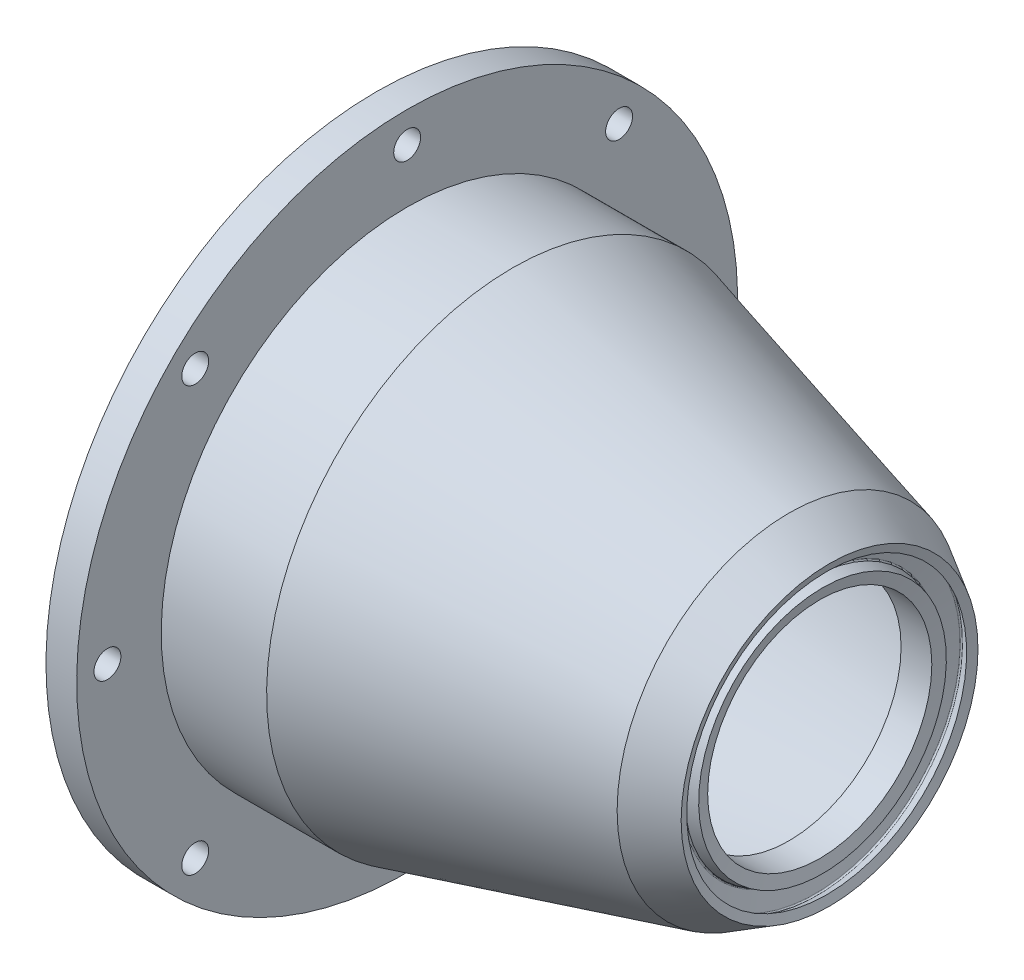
ISO-10303-21;
HEADER;
FILE_DESCRIPTION(('STEP AP214'),'2;1');
FILE_NAME('part.step','',(''),(''),'','','');
FILE_SCHEMA(('AUTOMOTIVE_DESIGN { 1 0 10303 214 1 1 1 1 }'));
ENDSEC;
DATA;
#1=APPLICATION_CONTEXT('core data for automotive mechanical design processes');
#2=APPLICATION_PROTOCOL_DEFINITION('international standard','automotive_design',2000,#1);
#3=PRODUCT_CONTEXT('',#1,'mechanical');
#4=PRODUCT('Part','Part','',(#3));
#5=PRODUCT_RELATED_PRODUCT_CATEGORY('part','',(#4));
#6=PRODUCT_DEFINITION_FORMATION('','',#4);
#7=PRODUCT_DEFINITION_CONTEXT('part definition',#1,'design');
#8=PRODUCT_DEFINITION('design','',#6,#7);
#9=PRODUCT_DEFINITION_SHAPE('','',#8);
#10=(LENGTH_UNIT() NAMED_UNIT(*) SI_UNIT(.MILLI.,.METRE.));
#11=(NAMED_UNIT(*) PLANE_ANGLE_UNIT() SI_UNIT($,.RADIAN.));
#12=(NAMED_UNIT(*) SI_UNIT($,.STERADIAN.) SOLID_ANGLE_UNIT());
#13=UNCERTAINTY_MEASURE_WITH_UNIT(LENGTH_MEASURE(1.E-05),#10,'distance_accuracy_value','');
#14=(GEOMETRIC_REPRESENTATION_CONTEXT(3) GLOBAL_UNCERTAINTY_ASSIGNED_CONTEXT((#13)) GLOBAL_UNIT_ASSIGNED_CONTEXT((#10,
#11,#12)) REPRESENTATION_CONTEXT('',''));
#15=CARTESIAN_POINT('',(0.,0.,0.));
#16=DIRECTION('',(0.,0.,1.));
#17=DIRECTION('',(1.,0.,0.));
#18=AXIS2_PLACEMENT_3D('',#15,#16,#17);
#19=CARTESIAN_POINT('',(-190.5,68.2625,0.));
#20=DIRECTION('',(-1.,0.,0.));
#21=DIRECTION('',(0.,-1.,0.));
#22=AXIS2_PLACEMENT_3D('',#19,#20,#21);
#23=PLANE('',#22);
#24=CARTESIAN_POINT('',(-190.5,0.,61.9125));
#25=DIRECTION('',(-1.,0.,0.));
#26=DIRECTION('',(0.,0.,1.));
#27=AXIS2_PLACEMENT_3D('',#24,#25,#26);
#28=CIRCLE('',#27,2.77812499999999);
#29=CARTESIAN_POINT('',(-190.5,0.,64.690625));
#30=VERTEX_POINT('',#29);
#31=EDGE_CURVE('E83',#30,#30,#28,.T.);
#32=ORIENTED_EDGE('',*,*,#31,.F.);
#33=EDGE_LOOP('',(#32));
#34=FACE_BOUND('',#33,.T.);
#35=CARTESIAN_POINT('',(-190.5,43.7787485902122,43.7787485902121));
#36=DIRECTION('',(-1.,0.,0.));
#37=DIRECTION('',(0.,0.,1.));
#38=AXIS2_PLACEMENT_3D('',#35,#36,#37);
#39=CIRCLE('',#38,2.77812499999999);
#40=CARTESIAN_POINT('',(-190.5,43.7787485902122,46.5568735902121));
#41=VERTEX_POINT('',#40);
#42=EDGE_CURVE('E73',#41,#41,#39,.T.);
#43=ORIENTED_EDGE('',*,*,#42,.F.);
#44=EDGE_LOOP('',(#43));
#45=FACE_BOUND('',#44,.T.);
#46=CARTESIAN_POINT('',(-190.5,61.9125000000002,0.));
#47=DIRECTION('',(-1.,0.,0.));
#48=DIRECTION('',(0.,0.,1.));
#49=AXIS2_PLACEMENT_3D('',#46,#47,#48);
#50=CIRCLE('',#49,2.77812499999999);
#51=CARTESIAN_POINT('',(-190.5,61.9125000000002,2.77812499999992));
#52=VERTEX_POINT('',#51);
#53=EDGE_CURVE('E70',#52,#52,#50,.T.);
#54=ORIENTED_EDGE('',*,*,#53,.F.);
#55=EDGE_LOOP('',(#54));
#56=FACE_BOUND('',#55,.T.);
#57=CARTESIAN_POINT('',(-190.5,-43.7787485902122,43.778748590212));
#58=DIRECTION('',(-1.,0.,0.));
#59=DIRECTION('',(0.,0.,1.));
#60=AXIS2_PLACEMENT_3D('',#57,#58,#59);
#61=CIRCLE('',#60,2.77812499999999);
#62=CARTESIAN_POINT('',(-190.5,-43.7787485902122,46.556873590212));
#63=VERTEX_POINT('',#62);
#64=EDGE_CURVE('E67',#63,#63,#61,.T.);
#65=ORIENTED_EDGE('',*,*,#64,.F.);
#66=EDGE_LOOP('',(#65));
#67=FACE_BOUND('',#66,.T.);
#68=CARTESIAN_POINT('',(-190.5,-61.9125000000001,-1.90819582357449E-13));
#69=DIRECTION('',(-1.,0.,0.));
#70=DIRECTION('',(0.,0.,1.));
#71=AXIS2_PLACEMENT_3D('',#68,#69,#70);
#72=CIRCLE('',#71,2.77812499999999);
#73=CARTESIAN_POINT('',(-190.5,-61.9125000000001,2.77812499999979));
#74=VERTEX_POINT('',#73);
#75=EDGE_CURVE('E63',#74,#74,#72,.T.);
#76=ORIENTED_EDGE('',*,*,#75,.F.);
#77=EDGE_LOOP('',(#76));
#78=FACE_BOUND('',#77,.T.);
#79=CARTESIAN_POINT('',(-190.5,43.7787485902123,-43.7787485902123));
#80=DIRECTION('',(-1.,0.,0.));
#81=DIRECTION('',(0.,0.,1.));
#82=AXIS2_PLACEMENT_3D('',#79,#80,#81);
#83=CIRCLE('',#82,2.77812499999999);
#84=CARTESIAN_POINT('',(-190.5,43.7787485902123,-41.0006235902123));
#85=VERTEX_POINT('',#84);
#86=EDGE_CURVE('E59',#85,#85,#83,.T.);
#87=ORIENTED_EDGE('',*,*,#86,.F.);
#88=EDGE_LOOP('',(#87));
#89=FACE_BOUND('',#88,.T.);
#90=CARTESIAN_POINT('',(-190.5,1.03024907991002E-13,-61.9125000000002));
#91=DIRECTION('',(-1.,0.,0.));
#92=DIRECTION('',(0.,0.,1.));
#93=AXIS2_PLACEMENT_3D('',#90,#91,#92);
#94=CIRCLE('',#93,2.77812499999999);
#95=CARTESIAN_POINT('',(-190.5,1.03024907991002E-13,-59.1343750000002));
#96=VERTEX_POINT('',#95);
#97=EDGE_CURVE('E55',#96,#96,#94,.T.);
#98=ORIENTED_EDGE('',*,*,#97,.F.);
#99=EDGE_LOOP('',(#98));
#100=FACE_BOUND('',#99,.T.);
#101=CARTESIAN_POINT('',(-190.5,-43.7787485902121,-43.7787485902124));
#102=DIRECTION('',(-1.,0.,0.));
#103=DIRECTION('',(0.,0.,1.));
#104=AXIS2_PLACEMENT_3D('',#101,#102,#103);
#105=CIRCLE('',#104,2.77812499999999);
#106=CARTESIAN_POINT('',(-190.5,-43.7787485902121,-41.0006235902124));
#107=VERTEX_POINT('',#106);
#108=EDGE_CURVE('E51',#107,#107,#105,.T.);
#109=ORIENTED_EDGE('',*,*,#108,.F.);
#110=EDGE_LOOP('',(#109));
#111=FACE_BOUND('',#110,.T.);
#112=CARTESIAN_POINT('',(-190.5,0.,0.));
#113=DIRECTION('',(1.,0.,0.));
#114=DIRECTION('',(0.,1.,0.));
#115=AXIS2_PLACEMENT_3D('',#112,#113,#114);
#116=CIRCLE('',#115,55.6117031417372);
#117=CARTESIAN_POINT('',(-190.5,55.6117031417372,0.));
#118=VERTEX_POINT('',#117);
#119=EDGE_CURVE('E50',#118,#118,#116,.T.);
#120=ORIENTED_EDGE('',*,*,#119,.T.);
#121=EDGE_LOOP('',(#120));
#122=FACE_BOUND('',#121,.T.);
#123=CARTESIAN_POINT('',(-190.5,0.,0.));
#124=DIRECTION('',(1.,0.,0.));
#125=DIRECTION('',(0.,1.,0.));
#126=AXIS2_PLACEMENT_3D('',#123,#124,#125);
#127=CIRCLE('',#126,68.2625);
#128=CARTESIAN_POINT('',(-190.5,68.2625,0.));
#129=VERTEX_POINT('',#128);
#130=EDGE_CURVE('E10',#129,#129,#127,.T.);
#131=ORIENTED_EDGE('',*,*,#130,.F.);
#132=EDGE_LOOP('',(#131));
#133=FACE_BOUND('',#132,.T.);
#134=ADVANCED_FACE('F31',(#34,#45,#56,#67,#78,#89,#100,#111,#122,#133),#23,.T.);
#135=CARTESIAN_POINT('',(0.,0.,0.));
#136=DIRECTION('',(1.,0.,0.));
#137=DIRECTION('',(0.,1.,0.));
#138=AXIS2_PLACEMENT_3D('',#135,#136,#137);
#139=CYLINDRICAL_SURFACE('',#138,68.2625);
#140=ORIENTED_EDGE('',*,*,#130,.T.);
#141=EDGE_LOOP('',(#140));
#142=FACE_BOUND('',#141,.T.);
#143=CARTESIAN_POINT('',(-184.15,0.,0.));
#144=DIRECTION('',(1.,0.,0.));
#145=DIRECTION('',(0.,1.,0.));
#146=AXIS2_PLACEMENT_3D('',#143,#144,#145);
#147=CIRCLE('',#146,68.2625);
#148=CARTESIAN_POINT('',(-184.15,68.2625,0.));
#149=VERTEX_POINT('',#148);
#150=EDGE_CURVE('E38',#149,#149,#147,.T.);
#151=ORIENTED_EDGE('',*,*,#150,.F.);
#152=EDGE_LOOP('',(#151));
#153=FACE_BOUND('',#152,.T.);
#154=ADVANCED_FACE('F168',(#142,#153),#139,.T.);
#155=CARTESIAN_POINT('',(-184.15,68.2625,0.));
#156=DIRECTION('',(1.,0.,0.));
#157=DIRECTION('',(0.,1.,0.));
#158=AXIS2_PLACEMENT_3D('',#155,#156,#157);
#159=PLANE('',#158);
#160=CARTESIAN_POINT('',(-184.15,0.,61.9125));
#161=DIRECTION('',(1.,0.,0.));
#162=DIRECTION('',(0.,1.,0.));
#163=AXIS2_PLACEMENT_3D('',#160,#161,#162);
#164=CIRCLE('',#163,2.77812499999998);
#165=CARTESIAN_POINT('',(-184.15,2.77812499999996,61.9125));
#166=VERTEX_POINT('',#165);
#167=EDGE_CURVE('E34',#166,#166,#164,.T.);
#168=ORIENTED_EDGE('',*,*,#167,.F.);
#169=EDGE_LOOP('',(#168));
#170=FACE_BOUND('',#169,.T.);
#171=CARTESIAN_POINT('',(-184.15,43.7787485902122,43.7787485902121));
#172=DIRECTION('',(1.,0.,0.));
#173=DIRECTION('',(0.,1.,0.));
#174=AXIS2_PLACEMENT_3D('',#171,#172,#173);
#175=CIRCLE('',#174,2.77812499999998);
#176=CARTESIAN_POINT('',(-184.15,46.5568735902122,43.7787485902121));
#177=VERTEX_POINT('',#176);
#178=EDGE_CURVE('E71',#177,#177,#175,.T.);
#179=ORIENTED_EDGE('',*,*,#178,.F.);
#180=EDGE_LOOP('',(#179));
#181=FACE_BOUND('',#180,.T.);
#182=CARTESIAN_POINT('',(-184.15,61.9125000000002,0.));
#183=DIRECTION('',(1.,0.,0.));
#184=DIRECTION('',(0.,1.,0.));
#185=AXIS2_PLACEMENT_3D('',#182,#183,#184);
#186=CIRCLE('',#185,2.77812499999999);
#187=CARTESIAN_POINT('',(-184.15,64.6906250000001,0.));
#188=VERTEX_POINT('',#187);
#189=EDGE_CURVE('E68',#188,#188,#186,.T.);
#190=ORIENTED_EDGE('',*,*,#189,.F.);
#191=EDGE_LOOP('',(#190));
#192=FACE_BOUND('',#191,.T.);
#193=CARTESIAN_POINT('',(-184.15,-43.7787485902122,43.778748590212));
#194=DIRECTION('',(1.,0.,0.));
#195=DIRECTION('',(0.,1.,0.));
#196=AXIS2_PLACEMENT_3D('',#193,#194,#195);
#197=CIRCLE('',#196,2.77812499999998);
#198=CARTESIAN_POINT('',(-184.15,-41.0006235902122,43.778748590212));
#199=VERTEX_POINT('',#198);
#200=EDGE_CURVE('E64',#199,#199,#197,.T.);
#201=ORIENTED_EDGE('',*,*,#200,.F.);
#202=EDGE_LOOP('',(#201));
#203=FACE_BOUND('',#202,.T.);
#204=CARTESIAN_POINT('',(-184.15,-61.9125000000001,-1.90819582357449E-13));
#205=DIRECTION('',(1.,0.,0.));
#206=DIRECTION('',(0.,1.,0.));
#207=AXIS2_PLACEMENT_3D('',#204,#205,#206);
#208=CIRCLE('',#207,2.77812499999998);
#209=CARTESIAN_POINT('',(-184.15,-59.1343750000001,-1.90819582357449E-13));
#210=VERTEX_POINT('',#209);
#211=EDGE_CURVE('E60',#210,#210,#208,.T.);
#212=ORIENTED_EDGE('',*,*,#211,.F.);
#213=EDGE_LOOP('',(#212));
#214=FACE_BOUND('',#213,.T.);
#215=CARTESIAN_POINT('',(-184.15,43.7787485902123,-43.7787485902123));
#216=DIRECTION('',(1.,0.,0.));
#217=DIRECTION('',(0.,1.,0.));
#218=AXIS2_PLACEMENT_3D('',#215,#216,#217);
#219=CIRCLE('',#218,2.77812499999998);
#220=CARTESIAN_POINT('',(-184.15,46.5568735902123,-43.7787485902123));
#221=VERTEX_POINT('',#220);
#222=EDGE_CURVE('E56',#221,#221,#219,.T.);
#223=ORIENTED_EDGE('',*,*,#222,.F.);
#224=EDGE_LOOP('',(#223));
#225=FACE_BOUND('',#224,.T.);
#226=CARTESIAN_POINT('',(-184.15,1.03024907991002E-13,-61.9125000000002));
#227=DIRECTION('',(1.,0.,0.));
#228=DIRECTION('',(0.,1.,0.));
#229=AXIS2_PLACEMENT_3D('',#226,#227,#228);
#230=CIRCLE('',#229,2.77812499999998);
#231=CARTESIAN_POINT('',(-184.15,2.77812500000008,-61.9125000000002));
#232=VERTEX_POINT('',#231);
#233=EDGE_CURVE('E52',#232,#232,#230,.T.);
#234=ORIENTED_EDGE('',*,*,#233,.F.);
#235=EDGE_LOOP('',(#234));
#236=FACE_BOUND('',#235,.T.);
#237=CARTESIAN_POINT('',(-184.15,-43.7787485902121,-43.7787485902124));
#238=DIRECTION('',(1.,0.,0.));
#239=DIRECTION('',(0.,1.,0.));
#240=AXIS2_PLACEMENT_3D('',#237,#238,#239);
#241=CIRCLE('',#240,2.77812499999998);
#242=CARTESIAN_POINT('',(-184.15,-41.0006235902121,-43.7787485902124));
#243=VERTEX_POINT('',#242);
#244=EDGE_CURVE('E47',#243,#243,#241,.T.);
#245=ORIENTED_EDGE('',*,*,#244,.F.);
#246=EDGE_LOOP('',(#245));
#247=FACE_BOUND('',#246,.T.);
#248=ORIENTED_EDGE('',*,*,#150,.T.);
#249=EDGE_LOOP('',(#248));
#250=FACE_BOUND('',#249,.T.);
#251=CARTESIAN_POINT('',(-184.15,0.,0.));
#252=DIRECTION('',(1.,0.,0.));
#253=DIRECTION('',(0.,1.,0.));
#254=AXIS2_PLACEMENT_3D('',#251,#252,#253);
#255=CIRCLE('',#254,50.8);
#256=CARTESIAN_POINT('',(-184.15,50.8,0.));
#257=VERTEX_POINT('',#256);
#258=EDGE_CURVE('E43',#257,#257,#255,.T.);
#259=ORIENTED_EDGE('',*,*,#258,.F.);
#260=EDGE_LOOP('',(#259));
#261=FACE_BOUND('',#260,.T.);
#262=ADVANCED_FACE('F166',(#170,#181,#192,#203,#214,#225,#236,#247,#250,#261),#159,.T.);
#263=CARTESIAN_POINT('',(0.,0.,0.));
#264=DIRECTION('',(1.,0.,0.));
#265=DIRECTION('',(0.,1.,0.));
#266=AXIS2_PLACEMENT_3D('',#263,#264,#265);
#267=CYLINDRICAL_SURFACE('',#266,50.8);
#268=ORIENTED_EDGE('',*,*,#258,.T.);
#269=EDGE_LOOP('',(#268));
#270=FACE_BOUND('',#269,.T.);
#271=CARTESIAN_POINT('',(-162.381972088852,0.,0.));
#272=DIRECTION('',(1.,0.,0.));
#273=DIRECTION('',(0.,1.,0.));
#274=AXIS2_PLACEMENT_3D('',#271,#272,#273);
#275=CIRCLE('',#274,50.8);
#276=CARTESIAN_POINT('',(-162.381972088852,50.8,0.));
#277=VERTEX_POINT('',#276);
#278=EDGE_CURVE('E158',#277,#277,#275,.T.);
#279=ORIENTED_EDGE('',*,*,#278,.F.);
#280=EDGE_LOOP('',(#279));
#281=FACE_BOUND('',#280,.T.);
#282=ADVANCED_FACE('F163',(#270,#281),#267,.T.);
#283=CARTESIAN_POINT('',(-105.280059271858,0.,0.));
#284=DIRECTION('',(-1.,0.,0.));
#285=DIRECTION('',(0.,-1.,0.));
#286=AXIS2_PLACEMENT_3D('',#283,#284,#285);
#287=CONICAL_SURFACE('',#286,35.4995885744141,0.26179938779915);
#288=ORIENTED_EDGE('',*,*,#278,.T.);
#289=EDGE_LOOP('',(#288));
#290=FACE_BOUND('',#289,.T.);
#291=CARTESIAN_POINT('',(-105.280059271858,0.,0.));
#292=DIRECTION('',(1.,0.,0.));
#293=DIRECTION('',(0.,1.,0.));
#294=AXIS2_PLACEMENT_3D('',#291,#292,#293);
#295=CIRCLE('',#294,35.4995885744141);
#296=CARTESIAN_POINT('',(-105.280059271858,35.4995885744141,0.));
#297=VERTEX_POINT('',#296);
#298=EDGE_CURVE('E155',#297,#297,#295,.T.);
#299=ORIENTED_EDGE('',*,*,#298,.F.);
#300=EDGE_LOOP('',(#299));
#301=FACE_BOUND('',#300,.T.);
#302=ADVANCED_FACE('F175',(#290,#301),#287,.T.);
#303=CARTESIAN_POINT('',(-96.8962445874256,0.,0.));
#304=DIRECTION('',(-1.,0.,0.));
#305=DIRECTION('',(0.,-1.,0.));
#306=AXIS2_PLACEMENT_3D('',#303,#304,#305);
#307=CONICAL_SURFACE('',#306,30.6591909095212,0.523598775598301);
#308=ORIENTED_EDGE('',*,*,#298,.T.);
#309=EDGE_LOOP('',(#308));
#310=FACE_BOUND('',#309,.T.);
#311=CARTESIAN_POINT('',(-96.8962445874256,0.,0.));
#312=DIRECTION('',(1.,0.,0.));
#313=DIRECTION('',(0.,1.,0.));
#314=AXIS2_PLACEMENT_3D('',#311,#312,#313);
#315=CIRCLE('',#314,30.6591909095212);
#316=CARTESIAN_POINT('',(-96.8962445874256,30.6591909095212,0.));
#317=VERTEX_POINT('',#316);
#318=EDGE_CURVE('E152',#317,#317,#315,.T.);
#319=ORIENTED_EDGE('',*,*,#318,.F.);
#320=EDGE_LOOP('',(#319));
#321=FACE_BOUND('',#320,.T.);
#322=ADVANCED_FACE('F286',(#310,#321),#307,.T.);
#323=CARTESIAN_POINT('',(-97.4972874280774,0.,0.));
#324=DIRECTION('',(1.,0.,0.));
#325=DIRECTION('',(0.,1.,0.));
#326=AXIS2_PLACEMENT_3D('',#323,#324,#325);
#327=CONICAL_SURFACE('',#326,28.9110715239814,1.23963538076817);
#328=ORIENTED_EDGE('',*,*,#318,.T.);
#329=EDGE_LOOP('',(#328));
#330=FACE_BOUND('',#329,.T.);
#331=CARTESIAN_POINT('',(-97.4972874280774,0.,0.));
#332=DIRECTION('',(1.,0.,0.));
#333=DIRECTION('',(0.,1.,0.));
#334=AXIS2_PLACEMENT_3D('',#331,#332,#333);
#335=CIRCLE('',#334,28.9110715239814);
#336=CARTESIAN_POINT('',(-97.4972874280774,28.9110715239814,0.));
#337=VERTEX_POINT('',#336);
#338=EDGE_CURVE('E149',#337,#337,#335,.T.);
#339=ORIENTED_EDGE('',*,*,#338,.F.);
#340=EDGE_LOOP('',(#339));
#341=FACE_BOUND('',#340,.T.);
#342=ADVANCED_FACE('F282',(#330,#341),#327,.F.);
#343=CARTESIAN_POINT('',(-99.4838969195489,0.,0.));
#344=DIRECTION('',(-1.,0.,0.));
#345=DIRECTION('',(0.,-1.,0.));
#346=AXIS2_PLACEMENT_3D('',#343,#344,#345);
#347=CONICAL_SURFACE('',#346,30.0580410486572,0.523598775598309);
#348=ORIENTED_EDGE('',*,*,#338,.T.);
#349=EDGE_LOOP('',(#348));
#350=FACE_BOUND('',#349,.T.);
#351=CARTESIAN_POINT('',(-99.4838969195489,0.,0.));
#352=DIRECTION('',(1.,0.,0.));
#353=DIRECTION('',(0.,1.,0.));
#354=AXIS2_PLACEMENT_3D('',#351,#352,#353);
#355=CIRCLE('',#354,30.0580410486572);
#356=CARTESIAN_POINT('',(-99.4838969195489,30.0580410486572,0.));
#357=VERTEX_POINT('',#356);
#358=EDGE_CURVE('E146',#357,#357,#355,.T.);
#359=ORIENTED_EDGE('',*,*,#358,.F.);
#360=EDGE_LOOP('',(#359));
#361=FACE_BOUND('',#360,.T.);
#362=ADVANCED_FACE('F278',(#350,#361),#347,.F.);
#363=CARTESIAN_POINT('',(-99.6108969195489,0.,0.));
#364=DIRECTION('',(1.,0.,0.));
#365=DIRECTION('',(0.,1.,0.));
#366=AXIS2_PLACEMENT_3D('',#363,#364,#365);
#367=TOROIDAL_SURFACE('',#366,29.8380705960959,0.254000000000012);
#368=ORIENTED_EDGE('',*,*,#358,.T.);
#369=EDGE_LOOP('',(#368));
#370=FACE_BOUND('',#369,.T.);
#371=CARTESIAN_POINT('',(-99.8562420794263,0.,0.));
#372=DIRECTION('',(1.,0.,0.));
#373=DIRECTION('',(0.,1.,0.));
#374=AXIS2_PLACEMENT_3D('',#371,#372,#373);
#375=CIRCLE('',#374,29.903810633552);
#376=CARTESIAN_POINT('',(-99.8562420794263,29.9038106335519,0.));
#377=VERTEX_POINT('',#376);
#378=EDGE_CURVE('E143',#377,#377,#375,.T.);
#379=ORIENTED_EDGE('',*,*,#378,.F.);
#380=EDGE_LOOP('',(#379));
#381=FACE_BOUND('',#380,.T.);
#382=ADVANCED_FACE('F274',(#370,#381),#367,.F.);
#383=CARTESIAN_POINT('',(-100.769816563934,0.,0.));
#384=DIRECTION('',(1.,0.,0.));
#385=DIRECTION('',(0.,1.,0.));
#386=AXIS2_PLACEMENT_3D('',#383,#384,#385);
#387=CONICAL_SURFACE('',#386,26.4943042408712,1.30899693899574);
#388=ORIENTED_EDGE('',*,*,#378,.T.);
#389=EDGE_LOOP('',(#388));
#390=FACE_BOUND('',#389,.T.);
#391=CARTESIAN_POINT('',(-100.769816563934,0.,0.));
#392=DIRECTION('',(1.,0.,0.));
#393=DIRECTION('',(0.,1.,0.));
#394=AXIS2_PLACEMENT_3D('',#391,#392,#393);
#395=CIRCLE('',#394,26.4943042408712);
#396=CARTESIAN_POINT('',(-100.769816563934,26.4943042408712,0.));
#397=VERTEX_POINT('',#396);
#398=EDGE_CURVE('E140',#397,#397,#395,.T.);
#399=ORIENTED_EDGE('',*,*,#398,.F.);
#400=EDGE_LOOP('',(#399));
#401=FACE_BOUND('',#400,.T.);
#402=ADVANCED_FACE('F270',(#390,#401),#387,.F.);
#403=CARTESIAN_POINT('',(-100.524471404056,0.,0.));
#404=DIRECTION('',(1.,0.,0.));
#405=DIRECTION('',(0.,1.,0.));
#406=AXIS2_PLACEMENT_3D('',#403,#404,#405);
#407=TOROIDAL_SURFACE('',#406,26.4285642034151,0.254000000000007);
#408=ORIENTED_EDGE('',*,*,#398,.T.);
#409=EDGE_LOOP('',(#408));
#410=FACE_BOUND('',#409,.T.);
#411=CARTESIAN_POINT('',(-100.590211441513,0.,0.));
#412=DIRECTION('',(1.,0.,0.));
#413=DIRECTION('',(0.,1.,0.));
#414=AXIS2_PLACEMENT_3D('',#411,#412,#413);
#415=CIRCLE('',#414,26.1832190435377);
#416=CARTESIAN_POINT('',(-100.590211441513,26.1832190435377,0.));
#417=VERTEX_POINT('',#416);
#418=EDGE_CURVE('E137',#417,#417,#415,.T.);
#419=ORIENTED_EDGE('',*,*,#418,.F.);
#420=EDGE_LOOP('',(#419));
#421=FACE_BOUND('',#420,.T.);
#422=ADVANCED_FACE('F266',(#410,#421),#407,.F.);
#423=CARTESIAN_POINT('',(-98.357570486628,0.,0.));
#424=DIRECTION('',(-1.,0.,0.));
#425=DIRECTION('',(0.,-1.,0.));
#426=AXIS2_PLACEMENT_3D('',#423,#424,#425);
#427=CONICAL_SURFACE('',#426,25.5849847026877,0.261799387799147);
#428=ORIENTED_EDGE('',*,*,#418,.T.);
#429=EDGE_LOOP('',(#428));
#430=FACE_BOUND('',#429,.T.);
#431=CARTESIAN_POINT('',(-98.357570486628,0.,0.));
#432=DIRECTION('',(1.,0.,0.));
#433=DIRECTION('',(0.,1.,0.));
#434=AXIS2_PLACEMENT_3D('',#431,#432,#433);
#435=CIRCLE('',#434,25.5849847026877);
#436=CARTESIAN_POINT('',(-98.357570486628,25.5849847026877,0.));
#437=VERTEX_POINT('',#436);
#438=EDGE_CURVE('E134',#437,#437,#435,.T.);
#439=ORIENTED_EDGE('',*,*,#438,.F.);
#440=EDGE_LOOP('',(#439));
#441=FACE_BOUND('',#440,.T.);
#442=ADVANCED_FACE('F262',(#430,#441),#427,.T.);
#443=CARTESIAN_POINT('',(-98.9269440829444,0.,0.));
#444=DIRECTION('',(1.,0.,0.));
#445=DIRECTION('',(0.,1.,0.));
#446=AXIS2_PLACEMENT_3D('',#443,#444,#445);
#447=CONICAL_SURFACE('',#446,23.1521,1.34090162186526);
#448=ORIENTED_EDGE('',*,*,#438,.T.);
#449=EDGE_LOOP('',(#448));
#450=FACE_BOUND('',#449,.T.);
#451=CARTESIAN_POINT('',(-98.9269440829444,0.,0.));
#452=DIRECTION('',(1.,0.,0.));
#453=DIRECTION('',(0.,1.,0.));
#454=AXIS2_PLACEMENT_3D('',#451,#452,#453);
#455=CIRCLE('',#454,23.1521);
#456=CARTESIAN_POINT('',(-98.9269440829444,23.1521,0.));
#457=VERTEX_POINT('',#456);
#458=EDGE_CURVE('E131',#457,#457,#455,.T.);
#459=ORIENTED_EDGE('',*,*,#458,.F.);
#460=EDGE_LOOP('',(#459));
#461=FACE_BOUND('',#460,.T.);
#462=ADVANCED_FACE('F258',(#450,#461),#447,.F.);
#463=CARTESIAN_POINT('',(0.,0.,0.));
#464=DIRECTION('',(1.,0.,0.));
#465=DIRECTION('',(0.,1.,0.));
#466=AXIS2_PLACEMENT_3D('',#463,#464,#465);
#467=CYLINDRICAL_SURFACE('',#466,23.1521);
#468=ORIENTED_EDGE('',*,*,#458,.T.);
#469=EDGE_LOOP('',(#468));
#470=FACE_BOUND('',#469,.T.);
#471=CARTESIAN_POINT('',(-105.276944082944,0.,0.));
#472=DIRECTION('',(1.,0.,0.));
#473=DIRECTION('',(0.,1.,0.));
#474=AXIS2_PLACEMENT_3D('',#471,#472,#473);
#475=CIRCLE('',#474,23.1521);
#476=CARTESIAN_POINT('',(-105.276944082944,23.1521,0.));
#477=VERTEX_POINT('',#476);
#478=EDGE_CURVE('E128',#477,#477,#475,.T.);
#479=ORIENTED_EDGE('',*,*,#478,.F.);
#480=EDGE_LOOP('',(#479));
#481=FACE_BOUND('',#480,.T.);
#482=ADVANCED_FACE('F254',(#470,#481),#467,.F.);
#483=CARTESIAN_POINT('',(-105.276944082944,23.1521,0.));
#484=DIRECTION('',(-1.,0.,0.));
#485=DIRECTION('',(0.,-1.,0.));
#486=AXIS2_PLACEMENT_3D('',#483,#484,#485);
#487=PLANE('',#486);
#488=ORIENTED_EDGE('',*,*,#478,.T.);
#489=EDGE_LOOP('',(#488));
#490=FACE_BOUND('',#489,.T.);
#491=CARTESIAN_POINT('',(-105.276944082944,0.,0.));
#492=DIRECTION('',(1.,0.,0.));
#493=DIRECTION('',(0.,1.,0.));
#494=AXIS2_PLACEMENT_3D('',#491,#492,#493);
#495=CIRCLE('',#494,32.2117519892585);
#496=CARTESIAN_POINT('',(-105.276944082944,32.2117519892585,0.));
#497=VERTEX_POINT('',#496);
#498=EDGE_CURVE('E125',#497,#497,#495,.T.);
#499=ORIENTED_EDGE('',*,*,#498,.F.);
#500=EDGE_LOOP('',(#499));
#501=FACE_BOUND('',#500,.T.);
#502=ADVANCED_FACE('F250',(#490,#501),#487,.T.);
#503=CARTESIAN_POINT('',(-162.799968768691,0.,0.));
#504=DIRECTION('',(-1.,0.,0.));
#505=DIRECTION('',(0.,-1.,0.));
#506=AXIS2_PLACEMENT_3D('',#503,#504,#505);
#507=CONICAL_SURFACE('',#506,47.625,0.26179938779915);
#508=ORIENTED_EDGE('',*,*,#498,.T.);
#509=EDGE_LOOP('',(#508));
#510=FACE_BOUND('',#509,.T.);
#511=CARTESIAN_POINT('',(-162.799968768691,0.,0.));
#512=DIRECTION('',(1.,0.,0.));
#513=DIRECTION('',(0.,1.,0.));
#514=AXIS2_PLACEMENT_3D('',#511,#512,#513);
#515=CIRCLE('',#514,47.625);
#516=CARTESIAN_POINT('',(-162.799968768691,47.625,0.));
#517=VERTEX_POINT('',#516);
#518=EDGE_CURVE('E122',#517,#517,#515,.T.);
#519=ORIENTED_EDGE('',*,*,#518,.F.);
#520=EDGE_LOOP('',(#519));
#521=FACE_BOUND('',#520,.T.);
#522=ADVANCED_FACE('F246',(#510,#521),#507,.F.);
#523=CARTESIAN_POINT('',(0.,0.,0.));
#524=DIRECTION('',(1.,0.,0.));
#525=DIRECTION('',(0.,1.,0.));
#526=AXIS2_PLACEMENT_3D('',#523,#524,#525);
#527=CYLINDRICAL_SURFACE('',#526,47.625);
#528=ORIENTED_EDGE('',*,*,#518,.T.);
#529=EDGE_LOOP('',(#528));
#530=FACE_BOUND('',#529,.T.);
#531=CARTESIAN_POINT('',(-192.8876,0.,0.));
#532=DIRECTION('',(1.,0.,0.));
#533=DIRECTION('',(0.,1.,0.));
#534=AXIS2_PLACEMENT_3D('',#531,#532,#533);
#535=CIRCLE('',#534,47.625);
#536=CARTESIAN_POINT('',(-192.8876,47.625,0.));
#537=VERTEX_POINT('',#536);
#538=EDGE_CURVE('E119',#537,#537,#535,.T.);
#539=ORIENTED_EDGE('',*,*,#538,.F.);
#540=EDGE_LOOP('',(#539));
#541=FACE_BOUND('',#540,.T.);
#542=ADVANCED_FACE('F242',(#530,#541),#527,.F.);
#543=CARTESIAN_POINT('',(-192.8876,50.927,0.));
#544=DIRECTION('',(-1.,0.,0.));
#545=DIRECTION('',(0.,-1.,0.));
#546=AXIS2_PLACEMENT_3D('',#543,#544,#545);
#547=PLANE('',#546);
#548=ORIENTED_EDGE('',*,*,#538,.T.);
#549=EDGE_LOOP('',(#548));
#550=FACE_BOUND('',#549,.T.);
#551=CARTESIAN_POINT('',(-192.8876,0.,0.));
#552=DIRECTION('',(1.,0.,0.));
#553=DIRECTION('',(0.,1.,0.));
#554=AXIS2_PLACEMENT_3D('',#551,#552,#553);
#555=CIRCLE('',#554,50.927);
#556=CARTESIAN_POINT('',(-192.8876,50.927,0.));
#557=VERTEX_POINT('',#556);
#558=EDGE_CURVE('E116',#557,#557,#555,.T.);
#559=ORIENTED_EDGE('',*,*,#558,.F.);
#560=EDGE_LOOP('',(#559));
#561=FACE_BOUND('',#560,.T.);
#562=ADVANCED_FACE('F238',(#550,#561),#547,.T.);
#563=CARTESIAN_POINT('',(0.,0.,0.));
#564=DIRECTION('',(1.,0.,0.));
#565=DIRECTION('',(0.,1.,0.));
#566=AXIS2_PLACEMENT_3D('',#563,#564,#565);
#567=CYLINDRICAL_SURFACE('',#566,50.927);
#568=ORIENTED_EDGE('',*,*,#558,.T.);
#569=EDGE_LOOP('',(#568));
#570=FACE_BOUND('',#569,.T.);
#571=CARTESIAN_POINT('',(-190.5,0.,0.));
#572=DIRECTION('',(1.,0.,0.));
#573=DIRECTION('',(0.,1.,0.));
#574=AXIS2_PLACEMENT_3D('',#571,#572,#573);
#575=CIRCLE('',#574,50.927);
#576=CARTESIAN_POINT('',(-190.5,50.927,0.));
#577=VERTEX_POINT('',#576);
#578=EDGE_CURVE('E113',#577,#577,#575,.T.);
#579=ORIENTED_EDGE('',*,*,#578,.F.);
#580=EDGE_LOOP('',(#579));
#581=FACE_BOUND('',#580,.T.);
#582=ADVANCED_FACE('F234',(#570,#581),#567,.T.);
#583=CARTESIAN_POINT('',(-190.5,50.927,0.));
#584=DIRECTION('',(-1.,0.,0.));
#585=DIRECTION('',(0.,-1.,0.));
#586=AXIS2_PLACEMENT_3D('',#583,#584,#585);
#587=PLANE('',#586);
#588=ORIENTED_EDGE('',*,*,#578,.T.);
#589=EDGE_LOOP('',(#588));
#590=FACE_BOUND('',#589,.T.);
#591=CARTESIAN_POINT('',(-190.5,0.,0.));
#592=DIRECTION('',(1.,0.,0.));
#593=DIRECTION('',(0.,1.,0.));
#594=AXIS2_PLACEMENT_3D('',#591,#592,#593);
#595=CIRCLE('',#594,52.1843);
#596=CARTESIAN_POINT('',(-190.5,52.1843,0.));
#597=VERTEX_POINT('',#596);
#598=EDGE_CURVE('E110',#597,#597,#595,.T.);
#599=ORIENTED_EDGE('',*,*,#598,.F.);
#600=EDGE_LOOP('',(#599));
#601=FACE_BOUND('',#600,.T.);
#602=ADVANCED_FACE('F230',(#590,#601),#587,.T.);
#603=CARTESIAN_POINT('',(0.,0.,0.));
#604=DIRECTION('',(1.,0.,0.));
#605=DIRECTION('',(0.,1.,0.));
#606=AXIS2_PLACEMENT_3D('',#603,#604,#605);
#607=CYLINDRICAL_SURFACE('',#606,52.1843);
#608=ORIENTED_EDGE('',*,*,#598,.T.);
#609=EDGE_LOOP('',(#608));
#610=FACE_BOUND('',#609,.T.);
#611=CARTESIAN_POINT('',(-188.1886,0.,0.));
#612=DIRECTION('',(1.,0.,0.));
#613=DIRECTION('',(0.,1.,0.));
#614=AXIS2_PLACEMENT_3D('',#611,#612,#613);
#615=CIRCLE('',#614,52.1843);
#616=CARTESIAN_POINT('',(-188.1886,52.1843,0.));
#617=VERTEX_POINT('',#616);
#618=EDGE_CURVE('E107',#617,#617,#615,.T.);
#619=ORIENTED_EDGE('',*,*,#618,.F.);
#620=EDGE_LOOP('',(#619));
#621=FACE_BOUND('',#620,.T.);
#622=ADVANCED_FACE('F226',(#610,#621),#607,.T.);
#623=CARTESIAN_POINT('',(-188.1886,0.,0.));
#624=DIRECTION('',(1.,0.,0.));
#625=DIRECTION('',(0.,1.,0.));
#626=AXIS2_PLACEMENT_3D('',#623,#624,#625);
#627=TOROIDAL_SURFACE('',#626,52.4383,0.254000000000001);
#628=ORIENTED_EDGE('',*,*,#618,.T.);
#629=EDGE_LOOP('',(#628));
#630=FACE_BOUND('',#629,.T.);
#631=CARTESIAN_POINT('',(-187.9346,0.,0.));
#632=DIRECTION('',(1.,0.,0.));
#633=DIRECTION('',(0.,1.,0.));
#634=AXIS2_PLACEMENT_3D('',#631,#632,#633);
#635=CIRCLE('',#634,52.4383);
#636=CARTESIAN_POINT('',(-187.9346,52.4383,0.));
#637=VERTEX_POINT('',#636);
#638=EDGE_CURVE('E104',#637,#637,#635,.T.);
#639=ORIENTED_EDGE('',*,*,#638,.F.);
#640=EDGE_LOOP('',(#639));
#641=FACE_BOUND('',#640,.T.);
#642=ADVANCED_FACE('F222',(#630,#641),#627,.F.);
#643=CARTESIAN_POINT('',(-187.9346,55.9680807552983,0.));
#644=DIRECTION('',(-1.,0.,0.));
#645=DIRECTION('',(0.,-1.,0.));
#646=AXIS2_PLACEMENT_3D('',#643,#644,#645);
#647=PLANE('',#646);
#648=ORIENTED_EDGE('',*,*,#638,.T.);
#649=EDGE_LOOP('',(#648));
#650=FACE_BOUND('',#649,.T.);
#651=CARTESIAN_POINT('',(-187.9346,0.,0.));
#652=DIRECTION('',(1.,0.,0.));
#653=DIRECTION('',(0.,1.,0.));
#654=AXIS2_PLACEMENT_3D('',#651,#652,#653);
#655=CIRCLE('',#654,55.9680807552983);
#656=CARTESIAN_POINT('',(-187.9346,55.9680807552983,0.));
#657=VERTEX_POINT('',#656);
#658=EDGE_CURVE('E101',#657,#657,#655,.T.);
#659=ORIENTED_EDGE('',*,*,#658,.F.);
#660=EDGE_LOOP('',(#659));
#661=FACE_BOUND('',#660,.T.);
#662=ADVANCED_FACE('F215',(#650,#661),#647,.T.);
#663=CARTESIAN_POINT('',(-188.1886,0.,0.));
#664=DIRECTION('',(1.,0.,0.));
#665=DIRECTION('',(0.,1.,0.));
#666=AXIS2_PLACEMENT_3D('',#663,#664,#665);
#667=TOROIDAL_SURFACE('',#666,55.9680807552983,0.254000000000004);
#668=ORIENTED_EDGE('',*,*,#658,.T.);
#669=EDGE_LOOP('',(#668));
#670=FACE_BOUND('',#669,.T.);
#671=CARTESIAN_POINT('',(-188.254340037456,0.,0.));
#672=DIRECTION('',(1.,0.,0.));
#673=DIRECTION('',(0.,1.,0.));
#674=AXIS2_PLACEMENT_3D('',#671,#672,#673);
#675=CIRCLE('',#674,56.2134259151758);
#676=CARTESIAN_POINT('',(-188.254340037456,56.2134259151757,0.));
#677=VERTEX_POINT('',#676);
#678=EDGE_CURVE('E98',#677,#677,#675,.T.);
#679=ORIENTED_EDGE('',*,*,#678,.F.);
#680=EDGE_LOOP('',(#679));
#681=FACE_BOUND('',#680,.T.);
#682=ADVANCED_FACE('F205',(#670,#681),#667,.F.);
#683=CARTESIAN_POINT('',(-190.5,0.,0.));
#684=DIRECTION('',(1.,0.,0.));
#685=DIRECTION('',(0.,1.,0.));
#686=AXIS2_PLACEMENT_3D('',#683,#684,#685);
#687=CONICAL_SURFACE('',#686,55.6117031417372,0.261799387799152);
#688=ORIENTED_EDGE('',*,*,#678,.T.);
#689=EDGE_LOOP('',(#688));
#690=FACE_BOUND('',#689,.T.);
#691=ORIENTED_EDGE('',*,*,#119,.F.);
#692=EDGE_LOOP('',(#691));
#693=FACE_BOUND('',#692,.T.);
#694=ADVANCED_FACE('F202',(#690,#693),#687,.F.);
#695=CARTESIAN_POINT('',(-190.5,-43.7787485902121,-43.7787485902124));
#696=DIRECTION('',(-1.,0.,0.));
#697=DIRECTION('',(0.,0.,1.));
#698=AXIS2_PLACEMENT_3D('',#695,#696,#697);
#699=CYLINDRICAL_SURFACE('',#698,2.77812499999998);
#700=ORIENTED_EDGE('',*,*,#244,.T.);
#701=EDGE_LOOP('',(#700));
#702=FACE_BOUND('',#701,.T.);
#703=ORIENTED_EDGE('',*,*,#108,.T.);
#704=EDGE_LOOP('',(#703));
#705=FACE_BOUND('',#704,.T.);
#706=ADVANCED_FACE('F204',(#702,#705),#699,.F.);
#707=CARTESIAN_POINT('',(-190.5,1.03024907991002E-13,-61.9125000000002));
#708=DIRECTION('',(-1.,0.,0.));
#709=DIRECTION('',(0.,0.,1.));
#710=AXIS2_PLACEMENT_3D('',#707,#708,#709);
#711=CYLINDRICAL_SURFACE('',#710,2.77812499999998);
#712=ORIENTED_EDGE('',*,*,#233,.T.);
#713=EDGE_LOOP('',(#712));
#714=FACE_BOUND('',#713,.T.);
#715=ORIENTED_EDGE('',*,*,#97,.T.);
#716=EDGE_LOOP('',(#715));
#717=FACE_BOUND('',#716,.T.);
#718=ADVANCED_FACE('F212',(#714,#717),#711,.F.);
#719=CARTESIAN_POINT('',(-190.5,43.7787485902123,-43.7787485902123));
#720=DIRECTION('',(-1.,0.,0.));
#721=DIRECTION('',(0.,0.,1.));
#722=AXIS2_PLACEMENT_3D('',#719,#720,#721);
#723=CYLINDRICAL_SURFACE('',#722,2.77812499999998);
#724=ORIENTED_EDGE('',*,*,#222,.T.);
#725=EDGE_LOOP('',(#724));
#726=FACE_BOUND('',#725,.T.);
#727=ORIENTED_EDGE('',*,*,#86,.T.);
#728=EDGE_LOOP('',(#727));
#729=FACE_BOUND('',#728,.T.);
#730=ADVANCED_FACE('F443',(#726,#729),#723,.F.);
#731=CARTESIAN_POINT('',(-190.5,-61.9125000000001,-1.90819582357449E-13));
#732=DIRECTION('',(-1.,0.,0.));
#733=DIRECTION('',(0.,0.,1.));
#734=AXIS2_PLACEMENT_3D('',#731,#732,#733);
#735=CYLINDRICAL_SURFACE('',#734,2.77812499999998);
#736=ORIENTED_EDGE('',*,*,#211,.T.);
#737=EDGE_LOOP('',(#736));
#738=FACE_BOUND('',#737,.T.);
#739=ORIENTED_EDGE('',*,*,#75,.T.);
#740=EDGE_LOOP('',(#739));
#741=FACE_BOUND('',#740,.T.);
#742=ADVANCED_FACE('F452',(#738,#741),#735,.F.);
#743=CARTESIAN_POINT('',(-190.5,-43.7787485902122,43.778748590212));
#744=DIRECTION('',(-1.,0.,0.));
#745=DIRECTION('',(0.,0.,1.));
#746=AXIS2_PLACEMENT_3D('',#743,#744,#745);
#747=CYLINDRICAL_SURFACE('',#746,2.77812499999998);
#748=ORIENTED_EDGE('',*,*,#200,.T.);
#749=EDGE_LOOP('',(#748));
#750=FACE_BOUND('',#749,.T.);
#751=ORIENTED_EDGE('',*,*,#64,.T.);
#752=EDGE_LOOP('',(#751));
#753=FACE_BOUND('',#752,.T.);
#754=ADVANCED_FACE('F462',(#750,#753),#747,.F.);
#755=CARTESIAN_POINT('',(-190.5,61.9125000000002,0.));
#756=DIRECTION('',(-1.,0.,0.));
#757=DIRECTION('',(0.,0.,1.));
#758=AXIS2_PLACEMENT_3D('',#755,#756,#757);
#759=CYLINDRICAL_SURFACE('',#758,2.77812499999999);
#760=ORIENTED_EDGE('',*,*,#189,.T.);
#761=EDGE_LOOP('',(#760));
#762=FACE_BOUND('',#761,.T.);
#763=ORIENTED_EDGE('',*,*,#53,.T.);
#764=EDGE_LOOP('',(#763));
#765=FACE_BOUND('',#764,.T.);
#766=ADVANCED_FACE('F472',(#762,#765),#759,.F.);
#767=CARTESIAN_POINT('',(-190.5,43.7787485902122,43.7787485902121));
#768=DIRECTION('',(-1.,0.,0.));
#769=DIRECTION('',(0.,0.,1.));
#770=AXIS2_PLACEMENT_3D('',#767,#768,#769);
#771=CYLINDRICAL_SURFACE('',#770,2.77812499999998);
#772=ORIENTED_EDGE('',*,*,#178,.T.);
#773=EDGE_LOOP('',(#772));
#774=FACE_BOUND('',#773,.T.);
#775=ORIENTED_EDGE('',*,*,#42,.T.);
#776=EDGE_LOOP('',(#775));
#777=FACE_BOUND('',#776,.T.);
#778=ADVANCED_FACE('F482',(#774,#777),#771,.F.);
#779=CARTESIAN_POINT('',(-190.5,0.,61.9125));
#780=DIRECTION('',(-1.,0.,0.));
#781=DIRECTION('',(0.,0.,1.));
#782=AXIS2_PLACEMENT_3D('',#779,#780,#781);
#783=CYLINDRICAL_SURFACE('',#782,2.77812499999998);
#784=ORIENTED_EDGE('',*,*,#167,.T.);
#785=EDGE_LOOP('',(#784));
#786=FACE_BOUND('',#785,.T.);
#787=ORIENTED_EDGE('',*,*,#31,.T.);
#788=EDGE_LOOP('',(#787));
#789=FACE_BOUND('',#788,.T.);
#790=ADVANCED_FACE('F492',(#786,#789),#783,.F.);
#791=CLOSED_SHELL('',(#134,#154,#262,#282,#302,#322,#342,#362,#382,#402,#422,#442,#462,#482,
#502,#522,#542,#562,#582,#602,#622,#642,#662,#682,#694,#706,#718,#730,#742,#754,#766,#778,#790));
#792=MANIFOLD_SOLID_BREP('B2',#791);
#793=ADVANCED_BREP_SHAPE_REPRESENTATION('',(#18,#792),#14);
#794=SHAPE_DEFINITION_REPRESENTATION(#9,#793);
ENDSEC;
END-ISO-10303-21;
